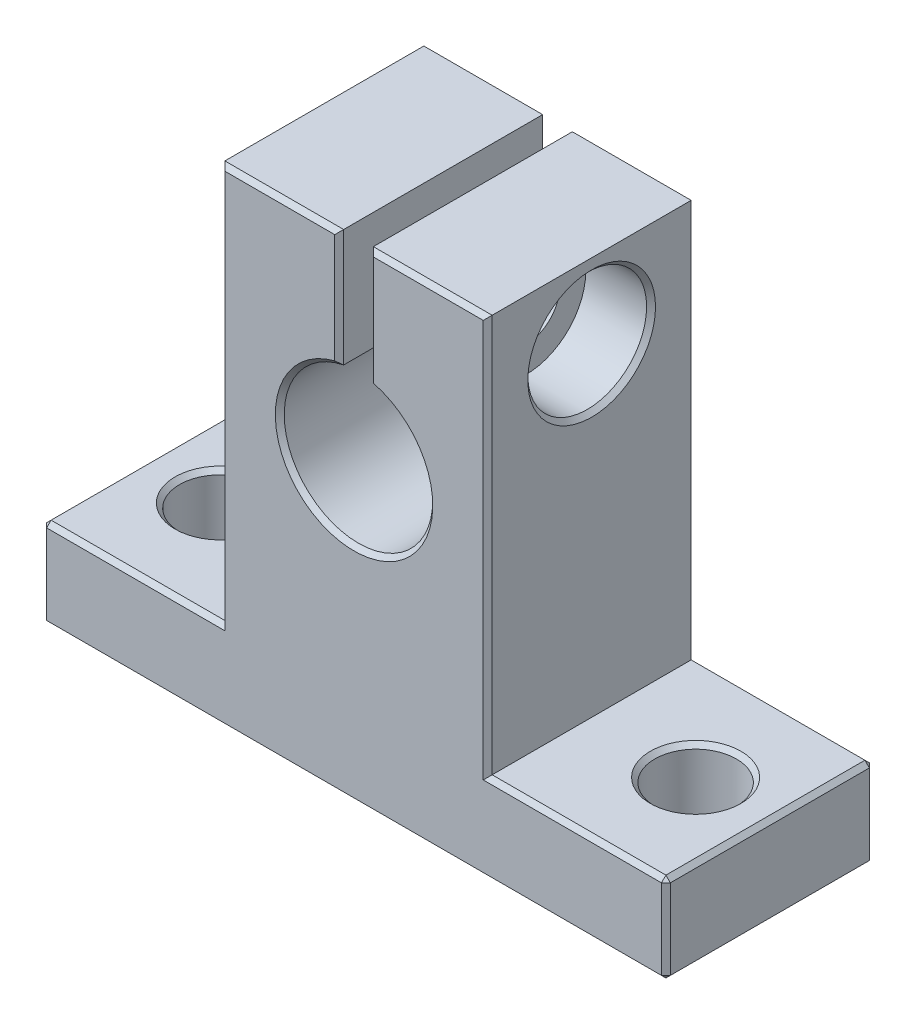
from build123d import *

# Parameters (mm, degrees)
SKETCH1_R                                           = 5
BOSS_EXTRUDE2_DEPTH                                 = 7
CUT_EXTRUDE1_REACH                                  = 43.386
SKETCH2_W                                           = 2
SKETCH2_H                                           = 9.822411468
HOLE2_D                                             = 5.5
CBORE_FOR_M4_HEX_SOCKET_HEAD_CAP_SCREW1_D           = 4.5
CBORE_FOR_M4_HEX_SOCKET_HEAD_CAP_SCREW1_CBORE_D     = 8
CBORE_FOR_M4_HEX_SOCKET_HEAD_CAP_SCREW1_CBORE_DEPTH = 4.4
CHAMFER1_SIZE                                       = 0.3
CHAMFER2_SIZE                                       = 0.3


with BuildPart() as part:
    # Sketch1 → Boss-Extrude2 (new, symmetric)
    with BuildSketch(Plane.XY):
        Polygon((21, 0), (-21, 0), (-21, 6), (-9, 6), (-9, 32.8), (9, 32.8), (9, 6), (21, 6), align=None)
        with Locations((0, 20)):
            Circle(SKETCH1_R, mode=Mode.SUBTRACT)
    extrude(amount=BOSS_EXTRUDE2_DEPTH, both=True)

    # Sketch2 → Cut-Extrude1 (cut, up to next)
    with BuildSketch(Plane.XY.offset(7), mode=Mode.PRIVATE) as cut_extrude1_sk1:
        with Locations((0, 27.888794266)):
            Rectangle(SKETCH2_W, SKETCH2_H)
    cut_extrude1_tool1 = extrude(cut_extrude1_sk1.sketch, amount=-CUT_EXTRUDE1_REACH, mode=Mode.PRIVATE) & part.part
    add(cut_extrude1_tool1.solids().sort_by_distance((0, 27.888794, 7))[0], mode=Mode.SUBTRACT)

    # Hole2 (through all)
    with Locations(Plane(origin=(-16, 6, 0), x_dir=(0, 0, 1), z_dir=(0, 1, 0))):
        with Locations((0, 0), (0, 32)):
            Hole(HOLE2_D / 2)

    # CBORE for M4 Hex Socket Head Cap Screw1 (through all)
    with Locations(Plane(origin=(9, 27.8, 0), x_dir=(0, 0, 1), z_dir=(1, 0, 0))):
        with Locations((0, 0)):
            CounterBoreHole(CBORE_FOR_M4_HEX_SOCKET_HEAD_CAP_SCREW1_D / 2, CBORE_FOR_M4_HEX_SOCKET_HEAD_CAP_SCREW1_CBORE_D / 2, CBORE_FOR_M4_HEX_SOCKET_HEAD_CAP_SCREW1_CBORE_DEPTH)

    # Chamfer1
    chamfer1_edges = [part.edges().sort_by_distance(p)[0] for p in [
        (16, 6, 2.75),
        (-16, 6, 2.75),
        (-9, 27.8, 2.25),
        (9, 27.8, -4),
    ]]
    chamfer(chamfer1_edges, length=CHAMFER1_SIZE)

    # Chamfer2
    chamfer2_edges = [part.edges().sort_by_distance(p)[0] for p in [
        (-5, 32.8, -7),
        (-9, 19.4, -7),
        (-15, 6, -7),
        (-21, 3, -7),
        (-9, 19.4, 7),
        (-21, 0, 0),
        (21, 0, 0),
        (21, 6, 0),
        (-21, 6, 0),
        (-5, 32.8, 7),
        (9, 19.4, 7),
        (15, 6, 7),
        (21, 3, 7),
        (0, 15, 7),
        (0, 15, -7),
        (5, 32.8, -7),
        (5, 32.8, 7),
        (0, 0, 7),
        (-1, 28.849489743, -7),
        (1, 28.849489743, 7),
        (-1, 28.849489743, 7),
        (1, 28.849489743, -7),
        (-21, 3, 7),
        (0, 0, -7),
        (-15, 6, 7),
        (21, 3, -7),
        (15, 6, -7),
        (9, 19.4, -7),
    ]]
    chamfer(chamfer2_edges, length=CHAMFER2_SIZE)


solid = part.part
